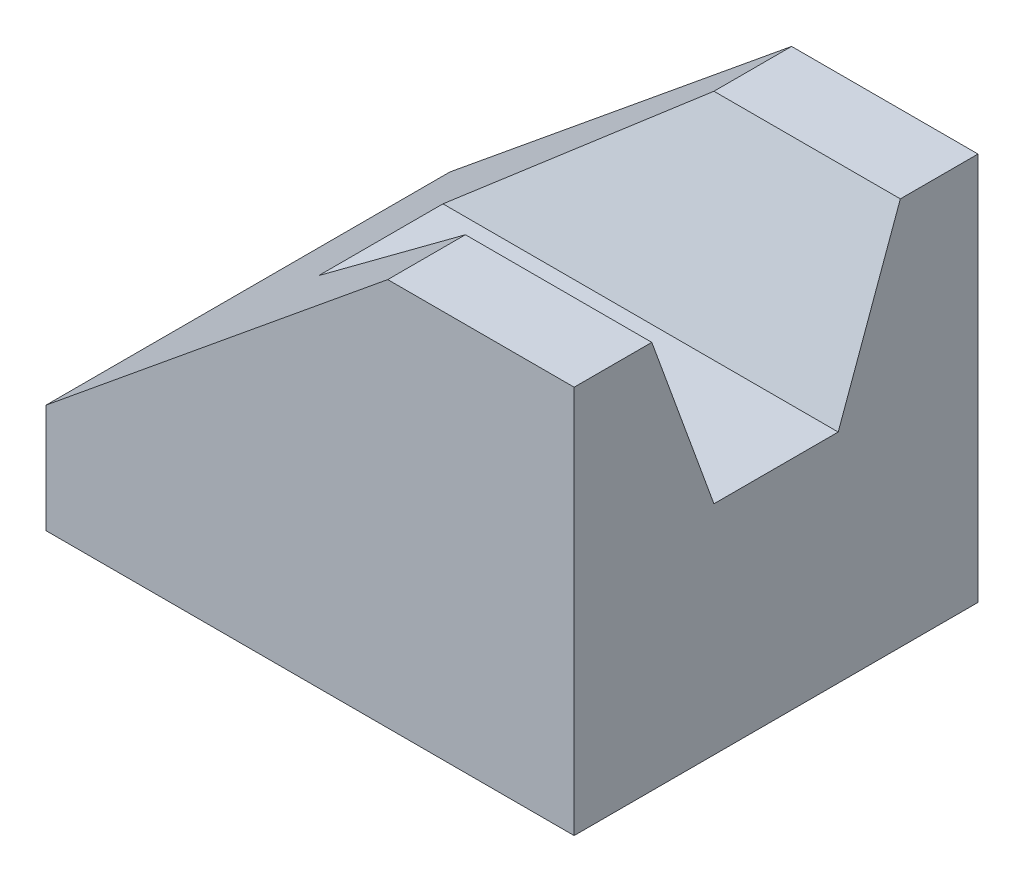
ISO-10303-21;
HEADER;
FILE_DESCRIPTION(('STEP AP214'),'2;1');
FILE_NAME('part.step','',(''),(''),'','','');
FILE_SCHEMA(('AUTOMOTIVE_DESIGN { 1 0 10303 214 1 1 1 1 }'));
ENDSEC;
DATA;
#1=APPLICATION_CONTEXT('core data for automotive mechanical design processes');
#2=APPLICATION_PROTOCOL_DEFINITION('international standard','automotive_design',2000,#1);
#3=PRODUCT_CONTEXT('',#1,'mechanical');
#4=PRODUCT('Part','Part','',(#3));
#5=PRODUCT_RELATED_PRODUCT_CATEGORY('part','',(#4));
#6=PRODUCT_DEFINITION_FORMATION('','',#4);
#7=PRODUCT_DEFINITION_CONTEXT('part definition',#1,'design');
#8=PRODUCT_DEFINITION('design','',#6,#7);
#9=PRODUCT_DEFINITION_SHAPE('','',#8);
#10=(LENGTH_UNIT() NAMED_UNIT(*) SI_UNIT(.MILLI.,.METRE.));
#11=(NAMED_UNIT(*) PLANE_ANGLE_UNIT() SI_UNIT($,.RADIAN.));
#12=(NAMED_UNIT(*) SI_UNIT($,.STERADIAN.) SOLID_ANGLE_UNIT());
#13=UNCERTAINTY_MEASURE_WITH_UNIT(LENGTH_MEASURE(1.E-05),#10,'distance_accuracy_value','');
#14=(GEOMETRIC_REPRESENTATION_CONTEXT(3) GLOBAL_UNCERTAINTY_ASSIGNED_CONTEXT((#13)) GLOBAL_UNIT_ASSIGNED_CONTEXT((#10,
#11,#12)) REPRESENTATION_CONTEXT('',''));
#15=CARTESIAN_POINT('',(0.,0.,0.));
#16=DIRECTION('',(0.,0.,1.));
#17=DIRECTION('',(1.,0.,0.));
#18=AXIS2_PLACEMENT_3D('',#15,#16,#17);
#19=CARTESIAN_POINT('',(0.,50.,0.));
#20=DIRECTION('',(0.,1.,0.));
#21=DIRECTION('',(0.,0.,1.));
#22=AXIS2_PLACEMENT_3D('',#19,#20,#21);
#23=PLANE('',#22);
#24=DIRECTION('',(1.,0.,0.));
#25=VECTOR('',#24,1.);
#26=CARTESIAN_POINT('',(-68.,50.,10.));
#27=LINE('',#26,#25);
#28=CARTESIAN_POINT('',(-24.,50.,10.));
#29=VERTEX_POINT('',#28);
#30=CARTESIAN_POINT('',(0.,50.,10.));
#31=VERTEX_POINT('',#30);
#32=EDGE_CURVE('E104',#29,#31,#27,.T.);
#33=ORIENTED_EDGE('',*,*,#32,.T.);
#34=DIRECTION('',(0.,0.,-1.));
#35=VECTOR('',#34,1.);
#36=CARTESIAN_POINT('',(0.,50.,52.));
#37=LINE('',#36,#35);
#38=CARTESIAN_POINT('',(0.,50.,0.));
#39=VERTEX_POINT('',#38);
#40=EDGE_CURVE('E117',#31,#39,#37,.T.);
#41=ORIENTED_EDGE('',*,*,#40,.T.);
#42=DIRECTION('',(-1.,0.,0.));
#43=VECTOR('',#42,1.);
#44=CARTESIAN_POINT('',(0.,50.,0.));
#45=LINE('',#44,#43);
#46=CARTESIAN_POINT('',(-24.,50.,0.));
#47=VERTEX_POINT('',#46);
#48=EDGE_CURVE('E131',#39,#47,#45,.T.);
#49=ORIENTED_EDGE('',*,*,#48,.T.);
#50=DIRECTION('',(0.,0.,-1.));
#51=VECTOR('',#50,1.);
#52=CARTESIAN_POINT('',(-24.,50.,52.));
#53=LINE('',#52,#51);
#54=EDGE_CURVE('E119',#29,#47,#53,.T.);
#55=ORIENTED_EDGE('',*,*,#54,.F.);
#56=EDGE_LOOP('',(#33,#41,#49,#55));
#57=FACE_BOUND('',#56,.T.);
#58=ADVANCED_FACE('F31',(#57),#23,.T.);
#59=CARTESIAN_POINT('',(0.,50.,0.));
#60=DIRECTION('',(0.,0.,1.));
#61=DIRECTION('',(1.,0.,0.));
#62=AXIS2_PLACEMENT_3D('',#59,#60,#61);
#63=PLANE('',#62);
#64=DIRECTION('',(0.773957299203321,0.633237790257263,0.));
#65=VECTOR('',#64,1.);
#66=CARTESIAN_POINT('',(-24.,50.,0.));
#67=LINE('',#66,#65);
#68=CARTESIAN_POINT('',(-68.,14.,0.));
#69=VERTEX_POINT('',#68);
#70=EDGE_CURVE('E175',#69,#47,#67,.T.);
#71=ORIENTED_EDGE('',*,*,#70,.T.);
#72=ORIENTED_EDGE('',*,*,#48,.F.);
#73=DIRECTION('',(0.,-1.,0.));
#74=VECTOR('',#73,1.);
#75=CARTESIAN_POINT('',(0.,50.,0.));
#76=LINE('',#75,#74);
#77=CARTESIAN_POINT('',(0.,0.,0.));
#78=VERTEX_POINT('',#77);
#79=EDGE_CURVE('E126',#39,#78,#76,.T.);
#80=ORIENTED_EDGE('',*,*,#79,.T.);
#81=DIRECTION('',(-1.,0.,0.));
#82=VECTOR('',#81,1.);
#83=CARTESIAN_POINT('',(0.,0.,0.));
#84=LINE('',#83,#82);
#85=CARTESIAN_POINT('',(-68.,0.,0.));
#86=VERTEX_POINT('',#85);
#87=EDGE_CURVE('E144',#78,#86,#84,.T.);
#88=ORIENTED_EDGE('',*,*,#87,.T.);
#89=DIRECTION('',(0.,-1.,0.));
#90=VECTOR('',#89,1.);
#91=CARTESIAN_POINT('',(-68.,50.,0.));
#92=LINE('',#91,#90);
#93=EDGE_CURVE('E153',#69,#86,#92,.T.);
#94=ORIENTED_EDGE('',*,*,#93,.F.);
#95=EDGE_LOOP('',(#71,#72,#80,#88,#94));
#96=FACE_BOUND('',#95,.T.);
#97=ADVANCED_FACE('F180',(#96),#63,.F.);
#98=CARTESIAN_POINT('',(-68.,50.,0.));
#99=DIRECTION('',(1.,0.,0.));
#100=DIRECTION('',(0.,0.,-1.));
#101=AXIS2_PLACEMENT_3D('',#98,#99,#100);
#102=PLANE('',#101);
#103=DIRECTION('',(0.,0.,-1.));
#104=VECTOR('',#103,1.);
#105=CARTESIAN_POINT('',(-68.,14.,52.));
#106=LINE('',#105,#104);
#107=CARTESIAN_POINT('',(-68.,14.,52.));
#108=VERTEX_POINT('',#107);
#109=EDGE_CURVE('E136',#108,#69,#106,.T.);
#110=ORIENTED_EDGE('',*,*,#109,.T.);
#111=ORIENTED_EDGE('',*,*,#93,.T.);
#112=DIRECTION('',(0.,0.,1.));
#113=VECTOR('',#112,1.);
#114=CARTESIAN_POINT('',(-68.,0.,0.));
#115=LINE('',#114,#113);
#116=CARTESIAN_POINT('',(-68.,0.,52.));
#117=VERTEX_POINT('',#116);
#118=EDGE_CURVE('E132',#86,#117,#115,.T.);
#119=ORIENTED_EDGE('',*,*,#118,.T.);
#120=DIRECTION('',(0.,-1.,0.));
#121=VECTOR('',#120,1.);
#122=CARTESIAN_POINT('',(-68.,50.,52.));
#123=LINE('',#122,#121);
#124=EDGE_CURVE('E151',#108,#117,#123,.T.);
#125=ORIENTED_EDGE('',*,*,#124,.F.);
#126=EDGE_LOOP('',(#110,#111,#119,#125));
#127=FACE_BOUND('',#126,.T.);
#128=ADVANCED_FACE('F183',(#127),#102,.F.);
#129=CARTESIAN_POINT('',(-68.,50.,52.));
#130=DIRECTION('',(0.,0.,-1.));
#131=DIRECTION('',(-1.,0.,0.));
#132=AXIS2_PLACEMENT_3D('',#129,#130,#131);
#133=PLANE('',#132);
#134=DIRECTION('',(0.773957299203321,0.633237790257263,0.));
#135=VECTOR('',#134,1.);
#136=CARTESIAN_POINT('',(-24.,50.,52.));
#137=LINE('',#136,#135);
#138=CARTESIAN_POINT('',(-24.,50.,52.));
#139=VERTEX_POINT('',#138);
#140=EDGE_CURVE('E54',#108,#139,#137,.T.);
#141=ORIENTED_EDGE('',*,*,#140,.F.);
#142=ORIENTED_EDGE('',*,*,#124,.T.);
#143=DIRECTION('',(1.,0.,0.));
#144=VECTOR('',#143,1.);
#145=CARTESIAN_POINT('',(-68.,0.,52.));
#146=LINE('',#145,#144);
#147=CARTESIAN_POINT('',(0.,0.,52.));
#148=VERTEX_POINT('',#147);
#149=EDGE_CURVE('E128',#117,#148,#146,.T.);
#150=ORIENTED_EDGE('',*,*,#149,.T.);
#151=DIRECTION('',(0.,-1.,0.));
#152=VECTOR('',#151,1.);
#153=CARTESIAN_POINT('',(0.,50.,52.));
#154=LINE('',#153,#152);
#155=CARTESIAN_POINT('',(0.,50.,52.));
#156=VERTEX_POINT('',#155);
#157=EDGE_CURVE('E141',#156,#148,#154,.T.);
#158=ORIENTED_EDGE('',*,*,#157,.F.);
#159=DIRECTION('',(1.,0.,0.));
#160=VECTOR('',#159,1.);
#161=CARTESIAN_POINT('',(-68.,50.,52.));
#162=LINE('',#161,#160);
#163=EDGE_CURVE('E139',#139,#156,#162,.T.);
#164=ORIENTED_EDGE('',*,*,#163,.F.);
#165=EDGE_LOOP('',(#141,#142,#150,#158,#164));
#166=FACE_BOUND('',#165,.T.);
#167=ADVANCED_FACE('F187',(#166),#133,.F.);
#168=DIRECTION('',(1.,0.,0.));
#169=VECTOR('',#168,1.);
#170=CARTESIAN_POINT('',(-68.,50.,42.));
#171=LINE('',#170,#169);
#172=CARTESIAN_POINT('',(-24.,50.,42.));
#173=VERTEX_POINT('',#172);
#174=CARTESIAN_POINT('',(0.,50.,42.));
#175=VERTEX_POINT('',#174);
#176=EDGE_CURVE('E120',#173,#175,#171,.T.);
#177=ORIENTED_EDGE('',*,*,#176,.F.);
#178=EDGE_CURVE('E162',#139,#173,#53,.T.);
#179=ORIENTED_EDGE('',*,*,#178,.F.);
#180=ORIENTED_EDGE('',*,*,#163,.T.);
#181=EDGE_CURVE('E127',#156,#175,#37,.T.);
#182=ORIENTED_EDGE('',*,*,#181,.T.);
#183=EDGE_LOOP('',(#177,#179,#180,#182));
#184=FACE_BOUND('',#183,.T.);
#185=ADVANCED_FACE('F167',(#184),#23,.T.);
#186=CARTESIAN_POINT('',(0.,50.,52.));
#187=DIRECTION('',(-1.,0.,0.));
#188=DIRECTION('',(0.,0.,1.));
#189=AXIS2_PLACEMENT_3D('',#186,#187,#188);
#190=PLANE('',#189);
#191=ORIENTED_EDGE('',*,*,#40,.F.);
#192=DIRECTION('',(0.,0.939793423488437,-0.341743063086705));
#193=VECTOR('',#192,1.);
#194=CARTESIAN_POINT('',(0.,28.,18.));
#195=LINE('',#194,#193);
#196=CARTESIAN_POINT('',(0.,28.,18.));
#197=VERTEX_POINT('',#196);
#198=EDGE_CURVE('E101',#197,#31,#195,.T.);
#199=ORIENTED_EDGE('',*,*,#198,.F.);
#200=DIRECTION('',(0.,0.,-1.));
#201=VECTOR('',#200,1.);
#202=CARTESIAN_POINT('',(0.,28.,18.));
#203=LINE('',#202,#201);
#204=CARTESIAN_POINT('',(0.,28.,34.));
#205=VERTEX_POINT('',#204);
#206=EDGE_CURVE('E121',#205,#197,#203,.T.);
#207=ORIENTED_EDGE('',*,*,#206,.F.);
#208=DIRECTION('',(0.,-0.939793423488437,-0.341743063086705));
#209=VECTOR('',#208,1.);
#210=CARTESIAN_POINT('',(0.,28.,34.));
#211=LINE('',#210,#209);
#212=EDGE_CURVE('E112',#175,#205,#211,.T.);
#213=ORIENTED_EDGE('',*,*,#212,.F.);
#214=ORIENTED_EDGE('',*,*,#181,.F.);
#215=ORIENTED_EDGE('',*,*,#157,.T.);
#216=DIRECTION('',(0.,0.,-1.));
#217=VECTOR('',#216,1.);
#218=CARTESIAN_POINT('',(0.,0.,52.));
#219=LINE('',#218,#217);
#220=EDGE_CURVE('E142',#148,#78,#219,.T.);
#221=ORIENTED_EDGE('',*,*,#220,.T.);
#222=ORIENTED_EDGE('',*,*,#79,.F.);
#223=EDGE_LOOP('',(#191,#199,#207,#213,#214,#215,#221,#222));
#224=FACE_BOUND('',#223,.T.);
#225=ADVANCED_FACE('F33',(#224),#190,.F.);
#226=CARTESIAN_POINT('',(0.,0.,0.));
#227=DIRECTION('',(0.,1.,0.));
#228=DIRECTION('',(0.,0.,1.));
#229=AXIS2_PLACEMENT_3D('',#226,#227,#228);
#230=PLANE('',#229);
#231=ORIENTED_EDGE('',*,*,#220,.F.);
#232=ORIENTED_EDGE('',*,*,#149,.F.);
#233=ORIENTED_EDGE('',*,*,#118,.F.);
#234=ORIENTED_EDGE('',*,*,#87,.F.);
#235=EDGE_LOOP('',(#231,#232,#233,#234));
#236=FACE_BOUND('',#235,.T.);
#237=ADVANCED_FACE('F193',(#236),#230,.F.);
#238=CARTESIAN_POINT('',(-24.,50.,52.));
#239=DIRECTION('',(-0.633237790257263,0.773957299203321,0.));
#240=DIRECTION('',(-0.773957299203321,-0.633237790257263,0.));
#241=AXIS2_PLACEMENT_3D('',#238,#239,#240);
#242=PLANE('',#241);
#243=DIRECTION('',(-0.754219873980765,-0.617088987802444,0.224395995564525));
#244=VECTOR('',#243,1.);
#245=CARTESIAN_POINT('',(-31.1082446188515,44.184163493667,12.1148496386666));
#246=LINE('',#245,#244);
#247=CARTESIAN_POINT('',(-50.8888888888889,28.,18.));
#248=VERTEX_POINT('',#247);
#249=EDGE_CURVE('E11',#29,#248,#246,.T.);
#250=ORIENTED_EDGE('',*,*,#249,.F.);
#251=ORIENTED_EDGE('',*,*,#54,.T.);
#252=ORIENTED_EDGE('',*,*,#70,.F.);
#253=ORIENTED_EDGE('',*,*,#109,.F.);
#254=ORIENTED_EDGE('',*,*,#140,.T.);
#255=ORIENTED_EDGE('',*,*,#178,.T.);
#256=DIRECTION('',(0.754219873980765,0.617088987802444,0.224395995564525));
#257=VECTOR('',#256,1.);
#258=CARTESIAN_POINT('',(-22.3075608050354,51.3847229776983,42.5035356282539));
#259=LINE('',#258,#257);
#260=CARTESIAN_POINT('',(-50.8888888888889,28.,34.));
#261=VERTEX_POINT('',#260);
#262=EDGE_CURVE('E156',#261,#173,#259,.T.);
#263=ORIENTED_EDGE('',*,*,#262,.F.);
#264=DIRECTION('',(0.,0.,1.));
#265=VECTOR('',#264,1.);
#266=CARTESIAN_POINT('',(-50.8888888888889,28.,52.));
#267=LINE('',#266,#265);
#268=EDGE_CURVE('E39',#248,#261,#267,.T.);
#269=ORIENTED_EDGE('',*,*,#268,.F.);
#270=EDGE_LOOP('',(#250,#251,#252,#253,#254,#255,#263,#269));
#271=FACE_BOUND('',#270,.T.);
#272=ADVANCED_FACE('F161',(#271),#242,.T.);
#273=CARTESIAN_POINT('',(-68.,28.,18.));
#274=DIRECTION('',(0.,-0.341743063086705,-0.939793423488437));
#275=DIRECTION('',(0.,0.939793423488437,-0.341743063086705));
#276=AXIS2_PLACEMENT_3D('',#273,#274,#275);
#277=PLANE('',#276);
#278=ORIENTED_EDGE('',*,*,#249,.T.);
#279=DIRECTION('',(1.,0.,0.));
#280=VECTOR('',#279,1.);
#281=CARTESIAN_POINT('',(-68.,28.,18.));
#282=LINE('',#281,#280);
#283=EDGE_CURVE('E107',#248,#197,#282,.T.);
#284=ORIENTED_EDGE('',*,*,#283,.T.);
#285=ORIENTED_EDGE('',*,*,#198,.T.);
#286=ORIENTED_EDGE('',*,*,#32,.F.);
#287=EDGE_LOOP('',(#278,#284,#285,#286));
#288=FACE_BOUND('',#287,.T.);
#289=ADVANCED_FACE('F103',(#288),#277,.F.);
#290=CARTESIAN_POINT('',(-68.,28.,18.));
#291=DIRECTION('',(0.,-1.,0.));
#292=DIRECTION('',(0.,0.,-1.));
#293=AXIS2_PLACEMENT_3D('',#290,#291,#292);
#294=PLANE('',#293);
#295=ORIENTED_EDGE('',*,*,#268,.T.);
#296=DIRECTION('',(1.,0.,0.));
#297=VECTOR('',#296,1.);
#298=CARTESIAN_POINT('',(-68.,28.,34.));
#299=LINE('',#298,#297);
#300=EDGE_CURVE('E46',#261,#205,#299,.T.);
#301=ORIENTED_EDGE('',*,*,#300,.T.);
#302=ORIENTED_EDGE('',*,*,#206,.T.);
#303=ORIENTED_EDGE('',*,*,#283,.F.);
#304=EDGE_LOOP('',(#295,#301,#302,#303));
#305=FACE_BOUND('',#304,.T.);
#306=ADVANCED_FACE('F160',(#305),#294,.F.);
#307=CARTESIAN_POINT('',(-68.,28.,34.));
#308=DIRECTION('',(0.,-0.341743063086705,0.939793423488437));
#309=DIRECTION('',(0.,-0.939793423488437,-0.341743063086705));
#310=AXIS2_PLACEMENT_3D('',#307,#308,#309);
#311=PLANE('',#310);
#312=ORIENTED_EDGE('',*,*,#262,.T.);
#313=ORIENTED_EDGE('',*,*,#176,.T.);
#314=ORIENTED_EDGE('',*,*,#212,.T.);
#315=ORIENTED_EDGE('',*,*,#300,.F.);
#316=EDGE_LOOP('',(#312,#313,#314,#315));
#317=FACE_BOUND('',#316,.T.);
#318=ADVANCED_FACE('F164',(#317),#311,.F.);
#319=CLOSED_SHELL('',(#58,#97,#128,#167,#185,#225,#237,#272,#289,#306,#318));
#320=MANIFOLD_SOLID_BREP('B2',#319);
#321=ADVANCED_BREP_SHAPE_REPRESENTATION('',(#18,#320),#14);
#322=SHAPE_DEFINITION_REPRESENTATION(#9,#321);
ENDSEC;
END-ISO-10303-21;
